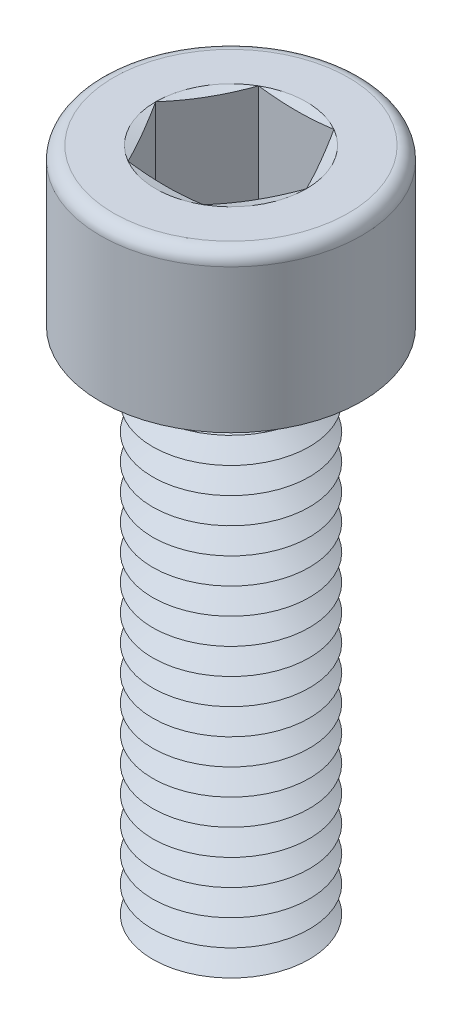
ISO-10303-21;
HEADER;
FILE_DESCRIPTION(('STEP AP214'),'2;1');
FILE_NAME('part.step','',(''),(''),'','','');
FILE_SCHEMA(('AUTOMOTIVE_DESIGN { 1 0 10303 214 1 1 1 1 }'));
ENDSEC;
DATA;
#1=APPLICATION_CONTEXT('core data for automotive mechanical design processes');
#2=APPLICATION_PROTOCOL_DEFINITION('international standard','automotive_design',2000,#1);
#3=PRODUCT_CONTEXT('',#1,'mechanical');
#4=PRODUCT('Part','Part','',(#3));
#5=PRODUCT_RELATED_PRODUCT_CATEGORY('part','',(#4));
#6=PRODUCT_DEFINITION_FORMATION('','',#4);
#7=PRODUCT_DEFINITION_CONTEXT('part definition',#1,'design');
#8=PRODUCT_DEFINITION('design','',#6,#7);
#9=PRODUCT_DEFINITION_SHAPE('','',#8);
#10=(LENGTH_UNIT() NAMED_UNIT(*) SI_UNIT(.MILLI.,.METRE.));
#11=(NAMED_UNIT(*) PLANE_ANGLE_UNIT() SI_UNIT($,.RADIAN.));
#12=(NAMED_UNIT(*) SI_UNIT($,.STERADIAN.) SOLID_ANGLE_UNIT());
#13=UNCERTAINTY_MEASURE_WITH_UNIT(LENGTH_MEASURE(1.E-05),#10,'distance_accuracy_value','');
#14=(GEOMETRIC_REPRESENTATION_CONTEXT(3) GLOBAL_UNCERTAINTY_ASSIGNED_CONTEXT((#13)) GLOBAL_UNIT_ASSIGNED_CONTEXT((#10,
#11,#12)) REPRESENTATION_CONTEXT('',''));
#15=CARTESIAN_POINT('',(0.,0.,0.));
#16=DIRECTION('',(0.,0.,1.));
#17=DIRECTION('',(1.,0.,0.));
#18=AXIS2_PLACEMENT_3D('',#15,#16,#17);
#19=CARTESIAN_POINT('',(0.,4.,0.));
#20=DIRECTION('',(0.,1.,0.));
#21=DIRECTION('',(0.,0.,1.));
#22=AXIS2_PLACEMENT_3D('',#19,#20,#21);
#23=CONICAL_SURFACE('',#22,2.13397459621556,1.0471975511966);
#24=CARTESIAN_POINT('',(0.,4.5,0.));
#25=DIRECTION('',(0.,1.,0.));
#26=DIRECTION('',(0.,0.,1.));
#27=AXIS2_PLACEMENT_3D('',#24,#25,#26);
#28=CIRCLE('',#27,3.);
#29=CARTESIAN_POINT('',(0.,4.5,3.));
#30=VERTEX_POINT('',#29);
#31=EDGE_CURVE('E471',#30,#30,#28,.T.);
#32=ORIENTED_EDGE('',*,*,#31,.F.);
#33=EDGE_LOOP('',(#32));
#34=FACE_BOUND('',#33,.T.);
#35=CARTESIAN_POINT('',(0.,4.,0.));
#36=DIRECTION('',(0.,1.,0.));
#37=DIRECTION('',(0.,0.,1.));
#38=AXIS2_PLACEMENT_3D('',#35,#36,#37);
#39=CIRCLE('',#38,2.13397459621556);
#40=CARTESIAN_POINT('',(0.,4.,2.13397459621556));
#41=VERTEX_POINT('',#40);
#42=EDGE_CURVE('E475',#41,#41,#39,.T.);
#43=ORIENTED_EDGE('',*,*,#42,.T.);
#44=EDGE_LOOP('',(#43));
#45=FACE_BOUND('',#44,.T.);
#46=ADVANCED_FACE('F41',(#34,#45),#23,.T.);
#47=CARTESIAN_POINT('',(0.,3.5,0.));
#48=DIRECTION('',(0.,-1.,0.));
#49=DIRECTION('',(0.,0.,-1.));
#50=AXIS2_PLACEMENT_3D('',#47,#48,#49);
#51=CONICAL_SURFACE('',#50,3.,1.0471975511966);
#52=ORIENTED_EDGE('',*,*,#42,.F.);
#53=EDGE_LOOP('',(#52));
#54=FACE_BOUND('',#53,.T.);
#55=CARTESIAN_POINT('',(0.,3.5,0.));
#56=DIRECTION('',(0.,1.,0.));
#57=DIRECTION('',(0.,0.,1.));
#58=AXIS2_PLACEMENT_3D('',#55,#56,#57);
#59=CIRCLE('',#58,3.);
#60=CARTESIAN_POINT('',(0.,3.5,3.));
#61=VERTEX_POINT('',#60);
#62=EDGE_CURVE('E479',#61,#61,#59,.T.);
#63=ORIENTED_EDGE('',*,*,#62,.T.);
#64=EDGE_LOOP('',(#63));
#65=FACE_BOUND('',#64,.T.);
#66=ADVANCED_FACE('F251',(#54,#65),#51,.T.);
#67=CARTESIAN_POINT('',(0.,0.,0.));
#68=DIRECTION('',(0.,1.,0.));
#69=DIRECTION('',(0.,0.,1.));
#70=AXIS2_PLACEMENT_3D('',#67,#68,#69);
#71=PLANE('',#70);
#72=CARTESIAN_POINT('',(0.,0.,0.));
#73=DIRECTION('',(0.,1.,0.));
#74=DIRECTION('',(0.,0.,1.));
#75=AXIS2_PLACEMENT_3D('',#72,#73,#74);
#76=CIRCLE('',#75,2.13397459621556);
#77=CARTESIAN_POINT('',(0.,0.,2.13397459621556));
#78=VERTEX_POINT('',#77);
#79=EDGE_CURVE('E507',#78,#78,#76,.T.);
#80=ORIENTED_EDGE('',*,*,#79,.F.);
#81=EDGE_LOOP('',(#80));
#82=FACE_BOUND('',#81,.T.);
#83=ADVANCED_FACE('F248',(#82),#71,.F.);
#84=CARTESIAN_POINT('',(0.,0.,0.));
#85=DIRECTION('',(0.,1.,0.));
#86=DIRECTION('',(0.,0.,1.));
#87=AXIS2_PLACEMENT_3D('',#84,#85,#86);
#88=CONICAL_SURFACE('',#87,2.13397459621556,1.0471975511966);
#89=CARTESIAN_POINT('',(0.,0.5,0.));
#90=DIRECTION('',(0.,1.,0.));
#91=DIRECTION('',(0.,0.,1.));
#92=AXIS2_PLACEMENT_3D('',#89,#90,#91);
#93=CIRCLE('',#92,3.);
#94=CARTESIAN_POINT('',(0.,0.5,3.));
#95=VERTEX_POINT('',#94);
#96=EDGE_CURVE('E503',#95,#95,#93,.T.);
#97=ORIENTED_EDGE('',*,*,#96,.F.);
#98=EDGE_LOOP('',(#97));
#99=FACE_BOUND('',#98,.T.);
#100=ORIENTED_EDGE('',*,*,#79,.T.);
#101=EDGE_LOOP('',(#100));
#102=FACE_BOUND('',#101,.T.);
#103=ADVANCED_FACE('F250',(#99,#102),#88,.T.);
#104=CARTESIAN_POINT('',(0.,0.5,0.));
#105=DIRECTION('',(0.,-1.,0.));
#106=DIRECTION('',(0.,0.,-1.));
#107=AXIS2_PLACEMENT_3D('',#104,#105,#106);
#108=CONICAL_SURFACE('',#107,3.,1.0471975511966);
#109=CARTESIAN_POINT('',(0.,1.,0.));
#110=DIRECTION('',(0.,1.,0.));
#111=DIRECTION('',(0.,0.,1.));
#112=AXIS2_PLACEMENT_3D('',#109,#110,#111);
#113=CIRCLE('',#112,2.13397459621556);
#114=CARTESIAN_POINT('',(0.,1.,2.13397459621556));
#115=VERTEX_POINT('',#114);
#116=EDGE_CURVE('E499',#115,#115,#113,.T.);
#117=ORIENTED_EDGE('',*,*,#116,.F.);
#118=EDGE_LOOP('',(#117));
#119=FACE_BOUND('',#118,.T.);
#120=ORIENTED_EDGE('',*,*,#96,.T.);
#121=EDGE_LOOP('',(#120));
#122=FACE_BOUND('',#121,.T.);
#123=ADVANCED_FACE('F291',(#119,#122),#108,.T.);
#124=CARTESIAN_POINT('',(0.,1.,0.));
#125=DIRECTION('',(0.,1.,0.));
#126=DIRECTION('',(0.,0.,1.));
#127=AXIS2_PLACEMENT_3D('',#124,#125,#126);
#128=CONICAL_SURFACE('',#127,2.13397459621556,1.0471975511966);
#129=CARTESIAN_POINT('',(0.,1.5,0.));
#130=DIRECTION('',(0.,1.,0.));
#131=DIRECTION('',(0.,0.,1.));
#132=AXIS2_PLACEMENT_3D('',#129,#130,#131);
#133=CIRCLE('',#132,3.);
#134=CARTESIAN_POINT('',(0.,1.5,3.));
#135=VERTEX_POINT('',#134);
#136=EDGE_CURVE('E495',#135,#135,#133,.T.);
#137=ORIENTED_EDGE('',*,*,#136,.F.);
#138=EDGE_LOOP('',(#137));
#139=FACE_BOUND('',#138,.T.);
#140=ORIENTED_EDGE('',*,*,#116,.T.);
#141=EDGE_LOOP('',(#140));
#142=FACE_BOUND('',#141,.T.);
#143=ADVANCED_FACE('F286',(#139,#142),#128,.T.);
#144=CARTESIAN_POINT('',(0.,1.5,0.));
#145=DIRECTION('',(0.,-1.,0.));
#146=DIRECTION('',(0.,0.,-1.));
#147=AXIS2_PLACEMENT_3D('',#144,#145,#146);
#148=CONICAL_SURFACE('',#147,3.,1.0471975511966);
#149=CARTESIAN_POINT('',(0.,2.,0.));
#150=DIRECTION('',(0.,1.,0.));
#151=DIRECTION('',(0.,0.,1.));
#152=AXIS2_PLACEMENT_3D('',#149,#150,#151);
#153=CIRCLE('',#152,2.13397459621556);
#154=CARTESIAN_POINT('',(0.,2.,2.13397459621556));
#155=VERTEX_POINT('',#154);
#156=EDGE_CURVE('E491',#155,#155,#153,.T.);
#157=ORIENTED_EDGE('',*,*,#156,.F.);
#158=EDGE_LOOP('',(#157));
#159=FACE_BOUND('',#158,.T.);
#160=ORIENTED_EDGE('',*,*,#136,.T.);
#161=EDGE_LOOP('',(#160));
#162=FACE_BOUND('',#161,.T.);
#163=ADVANCED_FACE('F283',(#159,#162),#148,.T.);
#164=CARTESIAN_POINT('',(0.,2.,0.));
#165=DIRECTION('',(0.,1.,0.));
#166=DIRECTION('',(0.,0.,1.));
#167=AXIS2_PLACEMENT_3D('',#164,#165,#166);
#168=CONICAL_SURFACE('',#167,2.13397459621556,1.0471975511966);
#169=CARTESIAN_POINT('',(0.,2.5,0.));
#170=DIRECTION('',(0.,1.,0.));
#171=DIRECTION('',(0.,0.,1.));
#172=AXIS2_PLACEMENT_3D('',#169,#170,#171);
#173=CIRCLE('',#172,3.);
#174=CARTESIAN_POINT('',(0.,2.5,3.));
#175=VERTEX_POINT('',#174);
#176=EDGE_CURVE('E487',#175,#175,#173,.T.);
#177=ORIENTED_EDGE('',*,*,#176,.F.);
#178=EDGE_LOOP('',(#177));
#179=FACE_BOUND('',#178,.T.);
#180=ORIENTED_EDGE('',*,*,#156,.T.);
#181=EDGE_LOOP('',(#180));
#182=FACE_BOUND('',#181,.T.);
#183=ADVANCED_FACE('F277',(#179,#182),#168,.T.);
#184=CARTESIAN_POINT('',(0.,2.5,0.));
#185=DIRECTION('',(0.,-1.,0.));
#186=DIRECTION('',(0.,0.,-1.));
#187=AXIS2_PLACEMENT_3D('',#184,#185,#186);
#188=CONICAL_SURFACE('',#187,3.,1.0471975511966);
#189=CARTESIAN_POINT('',(0.,3.,0.));
#190=DIRECTION('',(0.,1.,0.));
#191=DIRECTION('',(0.,0.,1.));
#192=AXIS2_PLACEMENT_3D('',#189,#190,#191);
#193=CIRCLE('',#192,2.13397459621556);
#194=CARTESIAN_POINT('',(0.,3.,2.13397459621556));
#195=VERTEX_POINT('',#194);
#196=EDGE_CURVE('E483',#195,#195,#193,.T.);
#197=ORIENTED_EDGE('',*,*,#196,.F.);
#198=EDGE_LOOP('',(#197));
#199=FACE_BOUND('',#198,.T.);
#200=ORIENTED_EDGE('',*,*,#176,.T.);
#201=EDGE_LOOP('',(#200));
#202=FACE_BOUND('',#201,.T.);
#203=ADVANCED_FACE('F273',(#199,#202),#188,.T.);
#204=CARTESIAN_POINT('',(0.,3.,0.));
#205=DIRECTION('',(0.,1.,0.));
#206=DIRECTION('',(0.,0.,1.));
#207=AXIS2_PLACEMENT_3D('',#204,#205,#206);
#208=CONICAL_SURFACE('',#207,2.13397459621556,1.0471975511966);
#209=ORIENTED_EDGE('',*,*,#62,.F.);
#210=EDGE_LOOP('',(#209));
#211=FACE_BOUND('',#210,.T.);
#212=ORIENTED_EDGE('',*,*,#196,.T.);
#213=EDGE_LOOP('',(#212));
#214=FACE_BOUND('',#213,.T.);
#215=ADVANCED_FACE('F276',(#211,#214),#208,.T.);
#216=CARTESIAN_POINT('',(0.,5.,0.));
#217=DIRECTION('',(0.,1.,0.));
#218=DIRECTION('',(0.,0.,1.));
#219=AXIS2_PLACEMENT_3D('',#216,#217,#218);
#220=CONICAL_SURFACE('',#219,2.13397459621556,1.0471975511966);
#221=CARTESIAN_POINT('',(0.,5.5,0.));
#222=DIRECTION('',(0.,1.,0.));
#223=DIRECTION('',(0.,0.,1.));
#224=AXIS2_PLACEMENT_3D('',#221,#222,#223);
#225=CIRCLE('',#224,3.);
#226=CARTESIAN_POINT('',(0.,5.5,3.));
#227=VERTEX_POINT('',#226);
#228=EDGE_CURVE('E463',#227,#227,#225,.T.);
#229=ORIENTED_EDGE('',*,*,#228,.F.);
#230=EDGE_LOOP('',(#229));
#231=FACE_BOUND('',#230,.T.);
#232=CARTESIAN_POINT('',(0.,5.,0.));
#233=DIRECTION('',(0.,1.,0.));
#234=DIRECTION('',(0.,0.,1.));
#235=AXIS2_PLACEMENT_3D('',#232,#233,#234);
#236=CIRCLE('',#235,2.13397459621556);
#237=CARTESIAN_POINT('',(0.,5.,2.13397459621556));
#238=VERTEX_POINT('',#237);
#239=EDGE_CURVE('E467',#238,#238,#236,.T.);
#240=ORIENTED_EDGE('',*,*,#239,.T.);
#241=EDGE_LOOP('',(#240));
#242=FACE_BOUND('',#241,.T.);
#243=ADVANCED_FACE('F281',(#231,#242),#220,.T.);
#244=CARTESIAN_POINT('',(0.,4.5,0.));
#245=DIRECTION('',(0.,-1.,0.));
#246=DIRECTION('',(0.,0.,-1.));
#247=AXIS2_PLACEMENT_3D('',#244,#245,#246);
#248=CONICAL_SURFACE('',#247,3.,1.0471975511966);
#249=ORIENTED_EDGE('',*,*,#239,.F.);
#250=EDGE_LOOP('',(#249));
#251=FACE_BOUND('',#250,.T.);
#252=ORIENTED_EDGE('',*,*,#31,.T.);
#253=EDGE_LOOP('',(#252));
#254=FACE_BOUND('',#253,.T.);
#255=ADVANCED_FACE('F738',(#251,#254),#248,.T.);
#256=CARTESIAN_POINT('',(0.,6.,0.));
#257=DIRECTION('',(0.,1.,0.));
#258=DIRECTION('',(0.,0.,1.));
#259=AXIS2_PLACEMENT_3D('',#256,#257,#258);
#260=CONICAL_SURFACE('',#259,2.13397459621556,1.0471975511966);
#261=CARTESIAN_POINT('',(0.,6.5,0.));
#262=DIRECTION('',(0.,1.,0.));
#263=DIRECTION('',(0.,0.,1.));
#264=AXIS2_PLACEMENT_3D('',#261,#262,#263);
#265=CIRCLE('',#264,3.);
#266=CARTESIAN_POINT('',(0.,6.5,3.));
#267=VERTEX_POINT('',#266);
#268=EDGE_CURVE('E455',#267,#267,#265,.T.);
#269=ORIENTED_EDGE('',*,*,#268,.F.);
#270=EDGE_LOOP('',(#269));
#271=FACE_BOUND('',#270,.T.);
#272=CARTESIAN_POINT('',(0.,6.,0.));
#273=DIRECTION('',(0.,1.,0.));
#274=DIRECTION('',(0.,0.,1.));
#275=AXIS2_PLACEMENT_3D('',#272,#273,#274);
#276=CIRCLE('',#275,2.13397459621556);
#277=CARTESIAN_POINT('',(0.,6.,2.13397459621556));
#278=VERTEX_POINT('',#277);
#279=EDGE_CURVE('E459',#278,#278,#276,.T.);
#280=ORIENTED_EDGE('',*,*,#279,.T.);
#281=EDGE_LOOP('',(#280));
#282=FACE_BOUND('',#281,.T.);
#283=ADVANCED_FACE('F747',(#271,#282),#260,.T.);
#284=CARTESIAN_POINT('',(0.,5.5,0.));
#285=DIRECTION('',(0.,-1.,0.));
#286=DIRECTION('',(0.,0.,-1.));
#287=AXIS2_PLACEMENT_3D('',#284,#285,#286);
#288=CONICAL_SURFACE('',#287,3.,1.0471975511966);
#289=ORIENTED_EDGE('',*,*,#279,.F.);
#290=EDGE_LOOP('',(#289));
#291=FACE_BOUND('',#290,.T.);
#292=ORIENTED_EDGE('',*,*,#228,.T.);
#293=EDGE_LOOP('',(#292));
#294=FACE_BOUND('',#293,.T.);
#295=ADVANCED_FACE('F757',(#291,#294),#288,.T.);
#296=CARTESIAN_POINT('',(0.,7.,0.));
#297=DIRECTION('',(0.,1.,0.));
#298=DIRECTION('',(0.,0.,1.));
#299=AXIS2_PLACEMENT_3D('',#296,#297,#298);
#300=CONICAL_SURFACE('',#299,2.13397459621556,1.0471975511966);
#301=CARTESIAN_POINT('',(0.,7.5,0.));
#302=DIRECTION('',(0.,1.,0.));
#303=DIRECTION('',(0.,0.,1.));
#304=AXIS2_PLACEMENT_3D('',#301,#302,#303);
#305=CIRCLE('',#304,3.);
#306=CARTESIAN_POINT('',(0.,7.5,3.));
#307=VERTEX_POINT('',#306);
#308=EDGE_CURVE('E447',#307,#307,#305,.T.);
#309=ORIENTED_EDGE('',*,*,#308,.F.);
#310=EDGE_LOOP('',(#309));
#311=FACE_BOUND('',#310,.T.);
#312=CARTESIAN_POINT('',(0.,7.,0.));
#313=DIRECTION('',(0.,1.,0.));
#314=DIRECTION('',(0.,0.,1.));
#315=AXIS2_PLACEMENT_3D('',#312,#313,#314);
#316=CIRCLE('',#315,2.13397459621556);
#317=CARTESIAN_POINT('',(0.,7.,2.13397459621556));
#318=VERTEX_POINT('',#317);
#319=EDGE_CURVE('E451',#318,#318,#316,.T.);
#320=ORIENTED_EDGE('',*,*,#319,.T.);
#321=EDGE_LOOP('',(#320));
#322=FACE_BOUND('',#321,.T.);
#323=ADVANCED_FACE('F767',(#311,#322),#300,.T.);
#324=CARTESIAN_POINT('',(0.,6.5,0.));
#325=DIRECTION('',(0.,-1.,0.));
#326=DIRECTION('',(0.,0.,-1.));
#327=AXIS2_PLACEMENT_3D('',#324,#325,#326);
#328=CONICAL_SURFACE('',#327,3.,1.0471975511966);
#329=ORIENTED_EDGE('',*,*,#319,.F.);
#330=EDGE_LOOP('',(#329));
#331=FACE_BOUND('',#330,.T.);
#332=ORIENTED_EDGE('',*,*,#268,.T.);
#333=EDGE_LOOP('',(#332));
#334=FACE_BOUND('',#333,.T.);
#335=ADVANCED_FACE('F777',(#331,#334),#328,.T.);
#336=CARTESIAN_POINT('',(0.,8.,0.));
#337=DIRECTION('',(0.,1.,0.));
#338=DIRECTION('',(0.,0.,1.));
#339=AXIS2_PLACEMENT_3D('',#336,#337,#338);
#340=CONICAL_SURFACE('',#339,2.13397459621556,1.0471975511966);
#341=CARTESIAN_POINT('',(0.,8.5,0.));
#342=DIRECTION('',(0.,1.,0.));
#343=DIRECTION('',(0.,0.,1.));
#344=AXIS2_PLACEMENT_3D('',#341,#342,#343);
#345=CIRCLE('',#344,3.);
#346=CARTESIAN_POINT('',(0.,8.5,3.));
#347=VERTEX_POINT('',#346);
#348=EDGE_CURVE('E439',#347,#347,#345,.T.);
#349=ORIENTED_EDGE('',*,*,#348,.F.);
#350=EDGE_LOOP('',(#349));
#351=FACE_BOUND('',#350,.T.);
#352=CARTESIAN_POINT('',(0.,8.,0.));
#353=DIRECTION('',(0.,1.,0.));
#354=DIRECTION('',(0.,0.,1.));
#355=AXIS2_PLACEMENT_3D('',#352,#353,#354);
#356=CIRCLE('',#355,2.13397459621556);
#357=CARTESIAN_POINT('',(0.,8.,2.13397459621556));
#358=VERTEX_POINT('',#357);
#359=EDGE_CURVE('E443',#358,#358,#356,.T.);
#360=ORIENTED_EDGE('',*,*,#359,.T.);
#361=EDGE_LOOP('',(#360));
#362=FACE_BOUND('',#361,.T.);
#363=ADVANCED_FACE('F787',(#351,#362),#340,.T.);
#364=CARTESIAN_POINT('',(0.,7.5,0.));
#365=DIRECTION('',(0.,-1.,0.));
#366=DIRECTION('',(0.,0.,-1.));
#367=AXIS2_PLACEMENT_3D('',#364,#365,#366);
#368=CONICAL_SURFACE('',#367,3.,1.0471975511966);
#369=ORIENTED_EDGE('',*,*,#359,.F.);
#370=EDGE_LOOP('',(#369));
#371=FACE_BOUND('',#370,.T.);
#372=ORIENTED_EDGE('',*,*,#308,.T.);
#373=EDGE_LOOP('',(#372));
#374=FACE_BOUND('',#373,.T.);
#375=ADVANCED_FACE('F797',(#371,#374),#368,.T.);
#376=CARTESIAN_POINT('',(0.,9.,0.));
#377=DIRECTION('',(0.,1.,0.));
#378=DIRECTION('',(0.,0.,1.));
#379=AXIS2_PLACEMENT_3D('',#376,#377,#378);
#380=CONICAL_SURFACE('',#379,2.13397459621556,1.0471975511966);
#381=CARTESIAN_POINT('',(0.,9.5,0.));
#382=DIRECTION('',(0.,1.,0.));
#383=DIRECTION('',(0.,0.,1.));
#384=AXIS2_PLACEMENT_3D('',#381,#382,#383);
#385=CIRCLE('',#384,3.);
#386=CARTESIAN_POINT('',(0.,9.5,3.));
#387=VERTEX_POINT('',#386);
#388=EDGE_CURVE('E431',#387,#387,#385,.T.);
#389=ORIENTED_EDGE('',*,*,#388,.F.);
#390=EDGE_LOOP('',(#389));
#391=FACE_BOUND('',#390,.T.);
#392=CARTESIAN_POINT('',(0.,9.,0.));
#393=DIRECTION('',(0.,1.,0.));
#394=DIRECTION('',(0.,0.,1.));
#395=AXIS2_PLACEMENT_3D('',#392,#393,#394);
#396=CIRCLE('',#395,2.13397459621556);
#397=CARTESIAN_POINT('',(0.,9.,2.13397459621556));
#398=VERTEX_POINT('',#397);
#399=EDGE_CURVE('E435',#398,#398,#396,.T.);
#400=ORIENTED_EDGE('',*,*,#399,.T.);
#401=EDGE_LOOP('',(#400));
#402=FACE_BOUND('',#401,.T.);
#403=ADVANCED_FACE('F807',(#391,#402),#380,.T.);
#404=CARTESIAN_POINT('',(0.,8.5,0.));
#405=DIRECTION('',(0.,-1.,0.));
#406=DIRECTION('',(0.,0.,-1.));
#407=AXIS2_PLACEMENT_3D('',#404,#405,#406);
#408=CONICAL_SURFACE('',#407,3.,1.0471975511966);
#409=ORIENTED_EDGE('',*,*,#399,.F.);
#410=EDGE_LOOP('',(#409));
#411=FACE_BOUND('',#410,.T.);
#412=ORIENTED_EDGE('',*,*,#348,.T.);
#413=EDGE_LOOP('',(#412));
#414=FACE_BOUND('',#413,.T.);
#415=ADVANCED_FACE('F817',(#411,#414),#408,.T.);
#416=CARTESIAN_POINT('',(0.,10.,0.));
#417=DIRECTION('',(0.,1.,0.));
#418=DIRECTION('',(0.,0.,1.));
#419=AXIS2_PLACEMENT_3D('',#416,#417,#418);
#420=CONICAL_SURFACE('',#419,2.13397459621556,1.0471975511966);
#421=CARTESIAN_POINT('',(0.,10.5,0.));
#422=DIRECTION('',(0.,1.,0.));
#423=DIRECTION('',(0.,0.,1.));
#424=AXIS2_PLACEMENT_3D('',#421,#422,#423);
#425=CIRCLE('',#424,3.);
#426=CARTESIAN_POINT('',(0.,10.5,3.));
#427=VERTEX_POINT('',#426);
#428=EDGE_CURVE('E423',#427,#427,#425,.T.);
#429=ORIENTED_EDGE('',*,*,#428,.F.);
#430=EDGE_LOOP('',(#429));
#431=FACE_BOUND('',#430,.T.);
#432=CARTESIAN_POINT('',(0.,10.,0.));
#433=DIRECTION('',(0.,1.,0.));
#434=DIRECTION('',(0.,0.,1.));
#435=AXIS2_PLACEMENT_3D('',#432,#433,#434);
#436=CIRCLE('',#435,2.13397459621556);
#437=CARTESIAN_POINT('',(0.,10.,2.13397459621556));
#438=VERTEX_POINT('',#437);
#439=EDGE_CURVE('E427',#438,#438,#436,.T.);
#440=ORIENTED_EDGE('',*,*,#439,.T.);
#441=EDGE_LOOP('',(#440));
#442=FACE_BOUND('',#441,.T.);
#443=ADVANCED_FACE('F827',(#431,#442),#420,.T.);
#444=CARTESIAN_POINT('',(0.,9.5,0.));
#445=DIRECTION('',(0.,-1.,0.));
#446=DIRECTION('',(0.,0.,-1.));
#447=AXIS2_PLACEMENT_3D('',#444,#445,#446);
#448=CONICAL_SURFACE('',#447,3.,1.0471975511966);
#449=ORIENTED_EDGE('',*,*,#439,.F.);
#450=EDGE_LOOP('',(#449));
#451=FACE_BOUND('',#450,.T.);
#452=ORIENTED_EDGE('',*,*,#388,.T.);
#453=EDGE_LOOP('',(#452));
#454=FACE_BOUND('',#453,.T.);
#455=ADVANCED_FACE('F837',(#451,#454),#448,.T.);
#456=CARTESIAN_POINT('',(0.,11.,0.));
#457=DIRECTION('',(0.,1.,0.));
#458=DIRECTION('',(0.,0.,1.));
#459=AXIS2_PLACEMENT_3D('',#456,#457,#458);
#460=CONICAL_SURFACE('',#459,2.13397459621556,1.0471975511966);
#461=CARTESIAN_POINT('',(0.,11.5,0.));
#462=DIRECTION('',(0.,1.,0.));
#463=DIRECTION('',(0.,0.,1.));
#464=AXIS2_PLACEMENT_3D('',#461,#462,#463);
#465=CIRCLE('',#464,3.);
#466=CARTESIAN_POINT('',(0.,11.5,3.));
#467=VERTEX_POINT('',#466);
#468=EDGE_CURVE('E415',#467,#467,#465,.T.);
#469=ORIENTED_EDGE('',*,*,#468,.F.);
#470=EDGE_LOOP('',(#469));
#471=FACE_BOUND('',#470,.T.);
#472=CARTESIAN_POINT('',(0.,11.,0.));
#473=DIRECTION('',(0.,1.,0.));
#474=DIRECTION('',(0.,0.,1.));
#475=AXIS2_PLACEMENT_3D('',#472,#473,#474);
#476=CIRCLE('',#475,2.13397459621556);
#477=CARTESIAN_POINT('',(0.,11.,2.13397459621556));
#478=VERTEX_POINT('',#477);
#479=EDGE_CURVE('E419',#478,#478,#476,.T.);
#480=ORIENTED_EDGE('',*,*,#479,.T.);
#481=EDGE_LOOP('',(#480));
#482=FACE_BOUND('',#481,.T.);
#483=ADVANCED_FACE('F847',(#471,#482),#460,.T.);
#484=CARTESIAN_POINT('',(0.,10.5,0.));
#485=DIRECTION('',(0.,-1.,0.));
#486=DIRECTION('',(0.,0.,-1.));
#487=AXIS2_PLACEMENT_3D('',#484,#485,#486);
#488=CONICAL_SURFACE('',#487,3.,1.0471975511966);
#489=ORIENTED_EDGE('',*,*,#479,.F.);
#490=EDGE_LOOP('',(#489));
#491=FACE_BOUND('',#490,.T.);
#492=ORIENTED_EDGE('',*,*,#428,.T.);
#493=EDGE_LOOP('',(#492));
#494=FACE_BOUND('',#493,.T.);
#495=ADVANCED_FACE('F857',(#491,#494),#488,.T.);
#496=CARTESIAN_POINT('',(0.,12.,0.));
#497=DIRECTION('',(0.,1.,0.));
#498=DIRECTION('',(0.,0.,1.));
#499=AXIS2_PLACEMENT_3D('',#496,#497,#498);
#500=CONICAL_SURFACE('',#499,2.13397459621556,1.0471975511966);
#501=CARTESIAN_POINT('',(0.,12.5,0.));
#502=DIRECTION('',(0.,1.,0.));
#503=DIRECTION('',(0.,0.,1.));
#504=AXIS2_PLACEMENT_3D('',#501,#502,#503);
#505=CIRCLE('',#504,3.);
#506=CARTESIAN_POINT('',(0.,12.5,3.));
#507=VERTEX_POINT('',#506);
#508=EDGE_CURVE('E407',#507,#507,#505,.T.);
#509=ORIENTED_EDGE('',*,*,#508,.F.);
#510=EDGE_LOOP('',(#509));
#511=FACE_BOUND('',#510,.T.);
#512=CARTESIAN_POINT('',(0.,12.,0.));
#513=DIRECTION('',(0.,1.,0.));
#514=DIRECTION('',(0.,0.,1.));
#515=AXIS2_PLACEMENT_3D('',#512,#513,#514);
#516=CIRCLE('',#515,2.13397459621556);
#517=CARTESIAN_POINT('',(0.,12.,2.13397459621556));
#518=VERTEX_POINT('',#517);
#519=EDGE_CURVE('E411',#518,#518,#516,.T.);
#520=ORIENTED_EDGE('',*,*,#519,.T.);
#521=EDGE_LOOP('',(#520));
#522=FACE_BOUND('',#521,.T.);
#523=ADVANCED_FACE('F867',(#511,#522),#500,.T.);
#524=CARTESIAN_POINT('',(0.,11.5,0.));
#525=DIRECTION('',(0.,-1.,0.));
#526=DIRECTION('',(0.,0.,-1.));
#527=AXIS2_PLACEMENT_3D('',#524,#525,#526);
#528=CONICAL_SURFACE('',#527,3.,1.0471975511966);
#529=ORIENTED_EDGE('',*,*,#519,.F.);
#530=EDGE_LOOP('',(#529));
#531=FACE_BOUND('',#530,.T.);
#532=ORIENTED_EDGE('',*,*,#468,.T.);
#533=EDGE_LOOP('',(#532));
#534=FACE_BOUND('',#533,.T.);
#535=ADVANCED_FACE('F877',(#531,#534),#528,.T.);
#536=CARTESIAN_POINT('',(0.,13.,0.));
#537=DIRECTION('',(0.,1.,0.));
#538=DIRECTION('',(0.,0.,1.));
#539=AXIS2_PLACEMENT_3D('',#536,#537,#538);
#540=CONICAL_SURFACE('',#539,2.13397459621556,1.0471975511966);
#541=CARTESIAN_POINT('',(0.,13.5,0.));
#542=DIRECTION('',(0.,1.,0.));
#543=DIRECTION('',(0.,0.,1.));
#544=AXIS2_PLACEMENT_3D('',#541,#542,#543);
#545=CIRCLE('',#544,3.);
#546=CARTESIAN_POINT('',(0.,13.5,3.));
#547=VERTEX_POINT('',#546);
#548=EDGE_CURVE('E399',#547,#547,#545,.T.);
#549=ORIENTED_EDGE('',*,*,#548,.F.);
#550=EDGE_LOOP('',(#549));
#551=FACE_BOUND('',#550,.T.);
#552=CARTESIAN_POINT('',(0.,13.,0.));
#553=DIRECTION('',(0.,1.,0.));
#554=DIRECTION('',(0.,0.,1.));
#555=AXIS2_PLACEMENT_3D('',#552,#553,#554);
#556=CIRCLE('',#555,2.13397459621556);
#557=CARTESIAN_POINT('',(0.,13.,2.13397459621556));
#558=VERTEX_POINT('',#557);
#559=EDGE_CURVE('E403',#558,#558,#556,.T.);
#560=ORIENTED_EDGE('',*,*,#559,.T.);
#561=EDGE_LOOP('',(#560));
#562=FACE_BOUND('',#561,.T.);
#563=ADVANCED_FACE('F887',(#551,#562),#540,.T.);
#564=CARTESIAN_POINT('',(0.,12.5,0.));
#565=DIRECTION('',(0.,-1.,0.));
#566=DIRECTION('',(0.,0.,-1.));
#567=AXIS2_PLACEMENT_3D('',#564,#565,#566);
#568=CONICAL_SURFACE('',#567,3.,1.0471975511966);
#569=ORIENTED_EDGE('',*,*,#559,.F.);
#570=EDGE_LOOP('',(#569));
#571=FACE_BOUND('',#570,.T.);
#572=ORIENTED_EDGE('',*,*,#508,.T.);
#573=EDGE_LOOP('',(#572));
#574=FACE_BOUND('',#573,.T.);
#575=ADVANCED_FACE('F897',(#571,#574),#568,.T.);
#576=CARTESIAN_POINT('',(0.,14.,0.));
#577=DIRECTION('',(0.,1.,0.));
#578=DIRECTION('',(0.,0.,1.));
#579=AXIS2_PLACEMENT_3D('',#576,#577,#578);
#580=CONICAL_SURFACE('',#579,2.13397459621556,1.0471975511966);
#581=CARTESIAN_POINT('',(0.,14.5,0.));
#582=DIRECTION('',(0.,1.,0.));
#583=DIRECTION('',(0.,0.,1.));
#584=AXIS2_PLACEMENT_3D('',#581,#582,#583);
#585=CIRCLE('',#584,3.);
#586=CARTESIAN_POINT('',(0.,14.5,3.));
#587=VERTEX_POINT('',#586);
#588=EDGE_CURVE('E391',#587,#587,#585,.T.);
#589=ORIENTED_EDGE('',*,*,#588,.F.);
#590=EDGE_LOOP('',(#589));
#591=FACE_BOUND('',#590,.T.);
#592=CARTESIAN_POINT('',(0.,14.,0.));
#593=DIRECTION('',(0.,1.,0.));
#594=DIRECTION('',(0.,0.,1.));
#595=AXIS2_PLACEMENT_3D('',#592,#593,#594);
#596=CIRCLE('',#595,2.13397459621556);
#597=CARTESIAN_POINT('',(0.,14.,2.13397459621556));
#598=VERTEX_POINT('',#597);
#599=EDGE_CURVE('E395',#598,#598,#596,.T.);
#600=ORIENTED_EDGE('',*,*,#599,.T.);
#601=EDGE_LOOP('',(#600));
#602=FACE_BOUND('',#601,.T.);
#603=ADVANCED_FACE('F907',(#591,#602),#580,.T.);
#604=CARTESIAN_POINT('',(0.,13.5,0.));
#605=DIRECTION('',(0.,-1.,0.));
#606=DIRECTION('',(0.,0.,-1.));
#607=AXIS2_PLACEMENT_3D('',#604,#605,#606);
#608=CONICAL_SURFACE('',#607,3.,1.0471975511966);
#609=ORIENTED_EDGE('',*,*,#599,.F.);
#610=EDGE_LOOP('',(#609));
#611=FACE_BOUND('',#610,.T.);
#612=ORIENTED_EDGE('',*,*,#548,.T.);
#613=EDGE_LOOP('',(#612));
#614=FACE_BOUND('',#613,.T.);
#615=ADVANCED_FACE('F917',(#611,#614),#608,.T.);
#616=CARTESIAN_POINT('',(0.,15.,0.));
#617=DIRECTION('',(0.,1.,0.));
#618=DIRECTION('',(0.,0.,1.));
#619=AXIS2_PLACEMENT_3D('',#616,#617,#618);
#620=CONICAL_SURFACE('',#619,2.13397459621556,1.0471975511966);
#621=CARTESIAN_POINT('',(0.,15.5,0.));
#622=DIRECTION('',(0.,1.,0.));
#623=DIRECTION('',(0.,0.,1.));
#624=AXIS2_PLACEMENT_3D('',#621,#622,#623);
#625=CIRCLE('',#624,3.);
#626=CARTESIAN_POINT('',(0.,15.5,3.));
#627=VERTEX_POINT('',#626);
#628=EDGE_CURVE('E383',#627,#627,#625,.T.);
#629=ORIENTED_EDGE('',*,*,#628,.F.);
#630=EDGE_LOOP('',(#629));
#631=FACE_BOUND('',#630,.T.);
#632=CARTESIAN_POINT('',(0.,15.,0.));
#633=DIRECTION('',(0.,1.,0.));
#634=DIRECTION('',(0.,0.,1.));
#635=AXIS2_PLACEMENT_3D('',#632,#633,#634);
#636=CIRCLE('',#635,2.13397459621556);
#637=CARTESIAN_POINT('',(0.,15.,2.13397459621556));
#638=VERTEX_POINT('',#637);
#639=EDGE_CURVE('E387',#638,#638,#636,.T.);
#640=ORIENTED_EDGE('',*,*,#639,.T.);
#641=EDGE_LOOP('',(#640));
#642=FACE_BOUND('',#641,.T.);
#643=ADVANCED_FACE('F927',(#631,#642),#620,.T.);
#644=CARTESIAN_POINT('',(0.,14.5,0.));
#645=DIRECTION('',(0.,-1.,0.));
#646=DIRECTION('',(0.,0.,-1.));
#647=AXIS2_PLACEMENT_3D('',#644,#645,#646);
#648=CONICAL_SURFACE('',#647,3.,1.0471975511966);
#649=ORIENTED_EDGE('',*,*,#639,.F.);
#650=EDGE_LOOP('',(#649));
#651=FACE_BOUND('',#650,.T.);
#652=ORIENTED_EDGE('',*,*,#588,.T.);
#653=EDGE_LOOP('',(#652));
#654=FACE_BOUND('',#653,.T.);
#655=ADVANCED_FACE('F937',(#651,#654),#648,.T.);
#656=CARTESIAN_POINT('',(0.,16.,0.));
#657=DIRECTION('',(0.,1.,0.));
#658=DIRECTION('',(0.,0.,1.));
#659=AXIS2_PLACEMENT_3D('',#656,#657,#658);
#660=CONICAL_SURFACE('',#659,2.13397459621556,1.0471975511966);
#661=CARTESIAN_POINT('',(0.,16.5,0.));
#662=DIRECTION('',(0.,1.,0.));
#663=DIRECTION('',(0.,0.,1.));
#664=AXIS2_PLACEMENT_3D('',#661,#662,#663);
#665=CIRCLE('',#664,3.);
#666=CARTESIAN_POINT('',(0.,16.5,3.));
#667=VERTEX_POINT('',#666);
#668=EDGE_CURVE('E375',#667,#667,#665,.T.);
#669=ORIENTED_EDGE('',*,*,#668,.F.);
#670=EDGE_LOOP('',(#669));
#671=FACE_BOUND('',#670,.T.);
#672=CARTESIAN_POINT('',(0.,16.,0.));
#673=DIRECTION('',(0.,1.,0.));
#674=DIRECTION('',(0.,0.,1.));
#675=AXIS2_PLACEMENT_3D('',#672,#673,#674);
#676=CIRCLE('',#675,2.13397459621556);
#677=CARTESIAN_POINT('',(0.,16.,2.13397459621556));
#678=VERTEX_POINT('',#677);
#679=EDGE_CURVE('E379',#678,#678,#676,.T.);
#680=ORIENTED_EDGE('',*,*,#679,.T.);
#681=EDGE_LOOP('',(#680));
#682=FACE_BOUND('',#681,.T.);
#683=ADVANCED_FACE('F947',(#671,#682),#660,.T.);
#684=CARTESIAN_POINT('',(0.,15.5,0.));
#685=DIRECTION('',(0.,-1.,0.));
#686=DIRECTION('',(0.,0.,-1.));
#687=AXIS2_PLACEMENT_3D('',#684,#685,#686);
#688=CONICAL_SURFACE('',#687,3.,1.0471975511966);
#689=ORIENTED_EDGE('',*,*,#679,.F.);
#690=EDGE_LOOP('',(#689));
#691=FACE_BOUND('',#690,.T.);
#692=ORIENTED_EDGE('',*,*,#628,.T.);
#693=EDGE_LOOP('',(#692));
#694=FACE_BOUND('',#693,.T.);
#695=ADVANCED_FACE('F957',(#691,#694),#688,.T.);
#696=CARTESIAN_POINT('',(0.,17.,0.));
#697=DIRECTION('',(0.,1.,0.));
#698=DIRECTION('',(0.,0.,1.));
#699=AXIS2_PLACEMENT_3D('',#696,#697,#698);
#700=CONICAL_SURFACE('',#699,2.13397459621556,1.0471975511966);
#701=CARTESIAN_POINT('',(0.,17.5,0.));
#702=DIRECTION('',(0.,1.,0.));
#703=DIRECTION('',(0.,0.,1.));
#704=AXIS2_PLACEMENT_3D('',#701,#702,#703);
#705=CIRCLE('',#704,3.);
#706=CARTESIAN_POINT('',(0.,17.5,3.));
#707=VERTEX_POINT('',#706);
#708=EDGE_CURVE('E368',#707,#707,#705,.T.);
#709=ORIENTED_EDGE('',*,*,#708,.F.);
#710=EDGE_LOOP('',(#709));
#711=FACE_BOUND('',#710,.T.);
#712=CARTESIAN_POINT('',(0.,17.,0.));
#713=DIRECTION('',(0.,1.,0.));
#714=DIRECTION('',(0.,0.,1.));
#715=AXIS2_PLACEMENT_3D('',#712,#713,#714);
#716=CIRCLE('',#715,2.13397459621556);
#717=CARTESIAN_POINT('',(0.,17.,2.13397459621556));
#718=VERTEX_POINT('',#717);
#719=EDGE_CURVE('E372',#718,#718,#716,.T.);
#720=ORIENTED_EDGE('',*,*,#719,.T.);
#721=EDGE_LOOP('',(#720));
#722=FACE_BOUND('',#721,.T.);
#723=ADVANCED_FACE('F967',(#711,#722),#700,.T.);
#724=CARTESIAN_POINT('',(0.,16.5,0.));
#725=DIRECTION('',(0.,-1.,0.));
#726=DIRECTION('',(0.,0.,-1.));
#727=AXIS2_PLACEMENT_3D('',#724,#725,#726);
#728=CONICAL_SURFACE('',#727,3.,1.0471975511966);
#729=ORIENTED_EDGE('',*,*,#719,.F.);
#730=EDGE_LOOP('',(#729));
#731=FACE_BOUND('',#730,.T.);
#732=ORIENTED_EDGE('',*,*,#668,.T.);
#733=EDGE_LOOP('',(#732));
#734=FACE_BOUND('',#733,.T.);
#735=ADVANCED_FACE('F977',(#731,#734),#728,.T.);
#736=CARTESIAN_POINT('',(0.,18.,0.));
#737=DIRECTION('',(0.,1.,0.));
#738=DIRECTION('',(0.,0.,1.));
#739=AXIS2_PLACEMENT_3D('',#736,#737,#738);
#740=CONICAL_SURFACE('',#739,2.13397459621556,1.0471975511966);
#741=CARTESIAN_POINT('',(0.,18.5,0.));
#742=DIRECTION('',(0.,1.,0.));
#743=DIRECTION('',(0.,0.,1.));
#744=AXIS2_PLACEMENT_3D('',#741,#742,#743);
#745=CIRCLE('',#744,3.);
#746=CARTESIAN_POINT('',(0.,18.5,3.));
#747=VERTEX_POINT('',#746);
#748=EDGE_CURVE('E353',#747,#747,#745,.T.);
#749=ORIENTED_EDGE('',*,*,#748,.F.);
#750=EDGE_LOOP('',(#749));
#751=FACE_BOUND('',#750,.T.);
#752=CARTESIAN_POINT('',(0.,18.,0.));
#753=DIRECTION('',(0.,1.,0.));
#754=DIRECTION('',(0.,0.,1.));
#755=AXIS2_PLACEMENT_3D('',#752,#753,#754);
#756=CIRCLE('',#755,2.13397459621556);
#757=CARTESIAN_POINT('',(0.,18.,2.13397459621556));
#758=VERTEX_POINT('',#757);
#759=EDGE_CURVE('E365',#758,#758,#756,.T.);
#760=ORIENTED_EDGE('',*,*,#759,.T.);
#761=EDGE_LOOP('',(#760));
#762=FACE_BOUND('',#761,.T.);
#763=ADVANCED_FACE('F987',(#751,#762),#740,.T.);
#764=CARTESIAN_POINT('',(0.,17.5,0.));
#765=DIRECTION('',(0.,-1.,0.));
#766=DIRECTION('',(0.,0.,-1.));
#767=AXIS2_PLACEMENT_3D('',#764,#765,#766);
#768=CONICAL_SURFACE('',#767,3.,1.0471975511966);
#769=ORIENTED_EDGE('',*,*,#759,.F.);
#770=EDGE_LOOP('',(#769));
#771=FACE_BOUND('',#770,.T.);
#772=ORIENTED_EDGE('',*,*,#708,.T.);
#773=EDGE_LOOP('',(#772));
#774=FACE_BOUND('',#773,.T.);
#775=ADVANCED_FACE('F997',(#771,#774),#768,.T.);
#776=CARTESIAN_POINT('',(0.,19.,0.));
#777=DIRECTION('',(0.,1.,0.));
#778=DIRECTION('',(0.,0.,1.));
#779=AXIS2_PLACEMENT_3D('',#776,#777,#778);
#780=CONICAL_SURFACE('',#779,2.13397459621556,1.0471975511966);
#781=CARTESIAN_POINT('',(0.,19.5,0.));
#782=DIRECTION('',(0.,1.,0.));
#783=DIRECTION('',(0.,0.,1.));
#784=AXIS2_PLACEMENT_3D('',#781,#782,#783);
#785=CIRCLE('',#784,3.);
#786=CARTESIAN_POINT('',(0.,19.5,3.));
#787=VERTEX_POINT('',#786);
#788=EDGE_CURVE('E360',#787,#787,#785,.T.);
#789=ORIENTED_EDGE('',*,*,#788,.F.);
#790=EDGE_LOOP('',(#789));
#791=FACE_BOUND('',#790,.T.);
#792=CARTESIAN_POINT('',(0.,19.,0.));
#793=DIRECTION('',(0.,1.,0.));
#794=DIRECTION('',(0.,0.,1.));
#795=AXIS2_PLACEMENT_3D('',#792,#793,#794);
#796=CIRCLE('',#795,2.13397459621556);
#797=CARTESIAN_POINT('',(0.,19.,2.13397459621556));
#798=VERTEX_POINT('',#797);
#799=EDGE_CURVE('E348',#798,#798,#796,.T.);
#800=ORIENTED_EDGE('',*,*,#799,.T.);
#801=EDGE_LOOP('',(#800));
#802=FACE_BOUND('',#801,.T.);
#803=ADVANCED_FACE('F1007',(#791,#802),#780,.T.);
#804=CARTESIAN_POINT('',(0.,18.5,0.));
#805=DIRECTION('',(0.,-1.,0.));
#806=DIRECTION('',(0.,0.,-1.));
#807=AXIS2_PLACEMENT_3D('',#804,#805,#806);
#808=CONICAL_SURFACE('',#807,3.,1.0471975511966);
#809=ORIENTED_EDGE('',*,*,#799,.F.);
#810=EDGE_LOOP('',(#809));
#811=FACE_BOUND('',#810,.T.);
#812=ORIENTED_EDGE('',*,*,#748,.T.);
#813=EDGE_LOOP('',(#812));
#814=FACE_BOUND('',#813,.T.);
#815=ADVANCED_FACE('F195',(#811,#814),#808,.T.);
#816=CARTESIAN_POINT('',(0.,26.,0.));
#817=DIRECTION('',(0.,1.,0.));
#818=DIRECTION('',(0.,0.,1.));
#819=AXIS2_PLACEMENT_3D('',#816,#817,#818);
#820=PLANE('',#819);
#821=CARTESIAN_POINT('',(0.,26.,0.));
#822=DIRECTION('',(0.,1.,0.));
#823=DIRECTION('',(0.,0.,1.));
#824=AXIS2_PLACEMENT_3D('',#821,#822,#823);
#825=CIRCLE('',#824,2.88675134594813);
#826=CARTESIAN_POINT('',(1.44337567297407,26.,2.5));
#827=VERTEX_POINT('',#826);
#828=CARTESIAN_POINT('',(2.88675134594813,26.,0.));
#829=VERTEX_POINT('',#828);
#830=EDGE_CURVE('E121',#827,#829,#825,.T.);
#831=ORIENTED_EDGE('',*,*,#830,.F.);
#832=CARTESIAN_POINT('',(0.,26.,0.));
#833=DIRECTION('',(0.,1.,0.));
#834=DIRECTION('',(0.,0.,1.));
#835=AXIS2_PLACEMENT_3D('',#832,#833,#834);
#836=CIRCLE('',#835,2.88675134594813);
#837=CARTESIAN_POINT('',(-1.44337567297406,26.,2.5));
#838=VERTEX_POINT('',#837);
#839=EDGE_CURVE('E45',#838,#827,#836,.T.);
#840=ORIENTED_EDGE('',*,*,#839,.F.);
#841=CARTESIAN_POINT('',(-2.88675134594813,26.,0.));
#842=VERTEX_POINT('',#841);
#843=EDGE_CURVE('E138',#842,#838,#836,.T.);
#844=ORIENTED_EDGE('',*,*,#843,.F.);
#845=CARTESIAN_POINT('',(-1.44337567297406,26.,-2.5));
#846=VERTEX_POINT('',#845);
#847=EDGE_CURVE('E1155',#846,#842,#836,.T.);
#848=ORIENTED_EDGE('',*,*,#847,.F.);
#849=CARTESIAN_POINT('',(1.44337567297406,26.,-2.5));
#850=VERTEX_POINT('',#849);
#851=EDGE_CURVE('E51',#850,#846,#836,.T.);
#852=ORIENTED_EDGE('',*,*,#851,.F.);
#853=EDGE_CURVE('E11',#829,#850,#836,.T.);
#854=ORIENTED_EDGE('',*,*,#853,.F.);
#855=EDGE_LOOP('',(#831,#840,#844,#848,#852,#854));
#856=FACE_BOUND('',#855,.T.);
#857=CARTESIAN_POINT('',(0.,26.,0.));
#858=DIRECTION('',(0.,1.,0.));
#859=DIRECTION('',(0.,0.,1.));
#860=AXIS2_PLACEMENT_3D('',#857,#858,#859);
#861=CIRCLE('',#860,4.5);
#862=CARTESIAN_POINT('',(0.,26.,4.5));
#863=VERTEX_POINT('',#862);
#864=EDGE_CURVE('E551',#863,#863,#861,.T.);
#865=ORIENTED_EDGE('',*,*,#864,.T.);
#866=EDGE_LOOP('',(#865));
#867=FACE_BOUND('',#866,.T.);
#868=ADVANCED_FACE('F140',(#856,#867),#820,.T.);
#869=CARTESIAN_POINT('',(0.,25.5,0.));
#870=DIRECTION('',(0.,1.,0.));
#871=DIRECTION('',(0.,0.,1.));
#872=AXIS2_PLACEMENT_3D('',#869,#870,#871);
#873=TOROIDAL_SURFACE('',#872,4.5,0.5);
#874=CARTESIAN_POINT('',(0.,25.5,0.));
#875=DIRECTION('',(0.,1.,0.));
#876=DIRECTION('',(0.,0.,1.));
#877=AXIS2_PLACEMENT_3D('',#874,#875,#876);
#878=CIRCLE('',#877,5.);
#879=CARTESIAN_POINT('',(0.,25.5,5.));
#880=VERTEX_POINT('',#879);
#881=EDGE_CURVE('E555',#880,#880,#878,.F.);
#882=ORIENTED_EDGE('',*,*,#881,.F.);
#883=EDGE_LOOP('',(#882));
#884=FACE_BOUND('',#883,.T.);
#885=ORIENTED_EDGE('',*,*,#864,.F.);
#886=EDGE_LOOP('',(#885));
#887=FACE_BOUND('',#886,.T.);
#888=ADVANCED_FACE('F43',(#884,#887),#873,.T.);
#889=CARTESIAN_POINT('',(0.,26.,0.));
#890=DIRECTION('',(0.,-1.,0.));
#891=DIRECTION('',(0.,0.,-1.));
#892=AXIS2_PLACEMENT_3D('',#889,#890,#891);
#893=CYLINDRICAL_SURFACE('',#892,5.);
#894=ORIENTED_EDGE('',*,*,#881,.T.);
#895=EDGE_LOOP('',(#894));
#896=FACE_BOUND('',#895,.T.);
#897=CARTESIAN_POINT('',(0.,20.,0.));
#898=DIRECTION('',(0.,1.,0.));
#899=DIRECTION('',(0.,0.,1.));
#900=AXIS2_PLACEMENT_3D('',#897,#898,#899);
#901=CIRCLE('',#900,5.);
#902=CARTESIAN_POINT('',(0.,20.,5.));
#903=VERTEX_POINT('',#902);
#904=EDGE_CURVE('E538',#903,#903,#901,.T.);
#905=ORIENTED_EDGE('',*,*,#904,.T.);
#906=EDGE_LOOP('',(#905));
#907=FACE_BOUND('',#906,.T.);
#908=ADVANCED_FACE('F243',(#896,#907),#893,.T.);
#909=CARTESIAN_POINT('',(0.,20.,0.));
#910=DIRECTION('',(0.,1.,0.));
#911=DIRECTION('',(0.,0.,1.));
#912=AXIS2_PLACEMENT_3D('',#909,#910,#911);
#913=PLANE('',#912);
#914=ORIENTED_EDGE('',*,*,#904,.F.);
#915=EDGE_LOOP('',(#914));
#916=FACE_BOUND('',#915,.T.);
#917=CARTESIAN_POINT('',(0.,20.,0.));
#918=DIRECTION('',(0.,1.,0.));
#919=DIRECTION('',(0.,0.,1.));
#920=AXIS2_PLACEMENT_3D('',#917,#918,#919);
#921=CIRCLE('',#920,3.);
#922=CARTESIAN_POINT('',(0.,20.,3.));
#923=VERTEX_POINT('',#922);
#924=EDGE_CURVE('E547',#923,#923,#921,.T.);
#925=ORIENTED_EDGE('',*,*,#924,.T.);
#926=EDGE_LOOP('',(#925));
#927=FACE_BOUND('',#926,.T.);
#928=ADVANCED_FACE('F239',(#916,#927),#913,.F.);
#929=CARTESIAN_POINT('',(0.,20.,0.));
#930=DIRECTION('',(0.,-1.,0.));
#931=DIRECTION('',(0.,0.,-1.));
#932=AXIS2_PLACEMENT_3D('',#929,#930,#931);
#933=CYLINDRICAL_SURFACE('',#932,3.);
#934=ORIENTED_EDGE('',*,*,#788,.T.);
#935=EDGE_LOOP('',(#934));
#936=FACE_BOUND('',#935,.T.);
#937=ORIENTED_EDGE('',*,*,#924,.F.);
#938=EDGE_LOOP('',(#937));
#939=FACE_BOUND('',#938,.T.);
#940=ADVANCED_FACE('F242',(#936,#939),#933,.T.);
#941=CARTESIAN_POINT('',(0.,26.,0.));
#942=DIRECTION('',(0.,1.,0.));
#943=DIRECTION('',(0.,0.,1.));
#944=AXIS2_PLACEMENT_3D('',#941,#942,#943);
#945=CONICAL_SURFACE('',#944,2.88675134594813,1.30899693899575);
#946=ORIENTED_EDGE('',*,*,#839,.T.);
#947=CARTESIAN_POINT('',(-3.76800948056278,26.4381461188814,2.5));
#948=CARTESIAN_POINT('',(-3.65512241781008,26.4129478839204,2.5));
#949=CARTESIAN_POINT('',(-3.54216337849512,26.3880668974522,2.5));
#950=CARTESIAN_POINT('',(-3.31606595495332,26.3391094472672,2.5));
#951=CARTESIAN_POINT('',(-3.202927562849,26.3150330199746,2.5));
#952=CARTESIAN_POINT('',(-2.97632910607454,26.2678326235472,2.5));
#953=CARTESIAN_POINT('',(-2.86286882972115,26.244709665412,2.5));
#954=CARTESIAN_POINT('',(-2.63570880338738,26.1996785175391,2.5));
#955=CARTESIAN_POINT('',(-2.522009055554,26.177770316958,2.5));
#956=CARTESIAN_POINT('',(-2.18246936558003,26.1146408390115,2.5));
#957=CARTESIAN_POINT('',(-1.95621666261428,26.0755946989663,2.5));
#958=CARTESIAN_POINT('',(-1.50233128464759,26.0064242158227,2.5));
#959=CARTESIAN_POINT('',(-1.27469889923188,25.9762980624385,2.5));
#960=CARTESIAN_POINT('',(-0.930935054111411,25.9407375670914,2.5));
#961=CARTESIAN_POINT('',(-0.815306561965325,25.9304588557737,2.5));
#962=CARTESIAN_POINT('',(-0.583775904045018,25.9137426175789,2.5));
#963=CARTESIAN_POINT('',(-0.467873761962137,25.9073047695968,2.5));
#964=CARTESIAN_POINT('',(-0.23595562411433,25.8986442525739,2.5));
#965=CARTESIAN_POINT('',(-0.119939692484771,25.8964198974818,2.5));
#966=CARTESIAN_POINT('',(0.112094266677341,25.8963223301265,2.5));
#967=CARTESIAN_POINT('',(0.228112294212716,25.8984491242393,2.5));
#968=CARTESIAN_POINT('',(0.460464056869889,25.9069362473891,2.5));
#969=CARTESIAN_POINT('',(0.576797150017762,25.9133138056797,2.5));
#970=CARTESIAN_POINT('',(0.809186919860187,25.9299460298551,2.5));
#971=CARTESIAN_POINT('',(0.925243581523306,25.9402009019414,2.5));
#972=CARTESIAN_POINT('',(1.1570783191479,25.9640809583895,2.5));
#973=CARTESIAN_POINT('',(1.27285617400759,25.9777082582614,2.5));
#974=CARTESIAN_POINT('',(1.50403978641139,26.0077859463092,2.5));
#975=CARTESIAN_POINT('',(1.61944554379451,26.0242363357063,2.5));
#976=CARTESIAN_POINT('',(1.97116037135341,26.0779484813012,2.5));
#977=CARTESIAN_POINT('',(2.20690405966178,26.1188940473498,2.5));
#978=CARTESIAN_POINT('',(2.67723558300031,26.2069642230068,2.5));
#979=CARTESIAN_POINT('',(2.9118232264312,26.2540898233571,2.5));
#980=CARTESIAN_POINT('',(3.38022088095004,26.3523532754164,2.5));
#981=CARTESIAN_POINT('',(3.61403064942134,26.4034922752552,2.5));
#982=CARTESIAN_POINT('',(4.08105387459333,26.5084282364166,2.5));
#983=CARTESIAN_POINT('',(4.31426731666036,26.5622252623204,2.5));
#984=CARTESIAN_POINT('',(4.77742011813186,26.6709766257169,2.5));
#985=CARTESIAN_POINT('',(5.00736469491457,26.7259088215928,2.5));
#986=CARTESIAN_POINT('',(5.46695141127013,26.8370433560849,2.5));
#987=CARTESIAN_POINT('',(5.69659354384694,26.8932457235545,2.5));
#988=CARTESIAN_POINT('',(6.15532898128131,27.006497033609,2.5));
#989=CARTESIAN_POINT('',(6.38442260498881,27.0635446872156,2.5));
#990=CARTESIAN_POINT('',(6.84242442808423,27.1783451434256,2.5));
#991=CARTESIAN_POINT('',(7.07133263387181,27.2360979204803,2.5));
#992=CARTESIAN_POINT('',(7.30017784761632,27.2940964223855,2.5));
#993=B_SPLINE_CURVE_WITH_KNOTS('',3,(#947,#948,#949,#950,#951,#952,#953,#954,#955,#956,#957,
#958,#959,#960,#961,#962,#963,#964,#965,#966,#967,#968,#969,#970,#971,#972,#973,#974,#975,#976,
#977,#978,#979,#980,#981,#982,#983,#984,#985,#986,#987,#988,#989,#990,#991,#992),.UNSPECIFIED.,
.F.,.F.,(4,2,2,2,2,2,2,2,2,2,2,2,2,2,2,2,2,2,2,2,2,2,4),(0.,0.346996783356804,0.694009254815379,
1.04138068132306,1.38874900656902,2.07743762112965,2.76598637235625,3.11418615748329,
3.46235682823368,3.81038814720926,4.15841997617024,4.50787110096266,4.85734081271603,
5.2070303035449,5.55671994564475,6.27438533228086,6.99216591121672,7.71015258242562,
8.42815670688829,9.13739674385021,9.84665290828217,10.5549206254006,11.2631627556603),.UNSPECIFIED.);
#994=EDGE_CURVE('E127',#838,#827,#993,.T.);
#995=ORIENTED_EDGE('',*,*,#994,.F.);
#996=EDGE_LOOP('',(#946,#995));
#997=FACE_BOUND('',#996,.T.);
#998=ADVANCED_FACE('F132',(#997),#945,.F.);
#999=ORIENTED_EDGE('',*,*,#843,.T.);
#1000=CARTESIAN_POINT('',(-2.88686681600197,26.000030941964,-0.00020000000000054));
#1001=CARTESIAN_POINT('',(-2.82691749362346,25.9839595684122,0.103635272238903));
#1002=CARTESIAN_POINT('',(-2.7668594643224,25.9693693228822,0.207658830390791));
#1003=CARTESIAN_POINT('',(-2.64653127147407,25.9437355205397,0.416073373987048));
#1004=CARTESIAN_POINT('',(-2.58626103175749,25.9326934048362,0.520464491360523));
#1005=CARTESIAN_POINT('',(-2.4658738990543,25.9148005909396,0.728981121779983));
#1006=CARTESIAN_POINT('',(-2.40575782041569,25.9079285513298,0.833105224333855));
#1007=CARTESIAN_POINT('',(-2.28544898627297,25.8987138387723,1.04148623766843));
#1008=CARTESIAN_POINT('',(-2.22525624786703,25.8963702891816,1.14574311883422));
#1009=CARTESIAN_POINT('',(-2.10487077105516,25.8963702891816,1.35425688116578));
#1010=CARTESIAN_POINT('',(-2.04467803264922,25.8987138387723,1.45851376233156));
#1011=CARTESIAN_POINT('',(-1.9243691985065,25.9079285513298,1.66689477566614));
#1012=CARTESIAN_POINT('',(-1.86425311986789,25.9148005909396,1.77101887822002));
#1013=CARTESIAN_POINT('',(-1.7438659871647,25.9326934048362,1.97953550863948));
#1014=CARTESIAN_POINT('',(-1.68359574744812,25.9437355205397,2.08392662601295));
#1015=CARTESIAN_POINT('',(-1.56326755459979,25.9693693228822,2.29234116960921));
#1016=CARTESIAN_POINT('',(-1.50320952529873,25.9839595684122,2.3963647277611));
#1017=CARTESIAN_POINT('',(-1.44326020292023,26.000030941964,2.5002));
#1018=B_SPLINE_CURVE_WITH_KNOTS('',3,(#1000,#1001,#1002,#1003,#1004,#1005,#1006,#1007,#1008,
#1009,#1010,#1011,#1012,#1013,#1014,#1015,#1016,#1017),.UNSPECIFIED.,.F.,.F.,(4,2,2,2,2,2,2,2,
4),(0.,0.362931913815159,0.726011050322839,1.08721601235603,1.44835104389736,1.80948607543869,
2.17069103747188,2.53377017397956,2.89670208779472),.UNSPECIFIED.);
#1019=EDGE_CURVE('E163',#842,#838,#1018,.T.);
#1020=ORIENTED_EDGE('',*,*,#1019,.F.);
#1021=EDGE_LOOP('',(#999,#1020));
#1022=FACE_BOUND('',#1021,.T.);
#1023=ADVANCED_FACE('F258',(#1022),#945,.F.);
#1024=ORIENTED_EDGE('',*,*,#847,.T.);
#1025=CARTESIAN_POINT('',(-1.44326020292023,26.000030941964,-2.5002));
#1026=CARTESIAN_POINT('',(-1.50320952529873,25.9839595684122,-2.3963647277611));
#1027=CARTESIAN_POINT('',(-1.56326755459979,25.9693693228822,-2.29234116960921));
#1028=CARTESIAN_POINT('',(-1.68359574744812,25.9437355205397,-2.08392662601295));
#1029=CARTESIAN_POINT('',(-1.7438659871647,25.9326934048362,-1.97953550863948));
#1030=CARTESIAN_POINT('',(-1.86425311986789,25.9148005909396,-1.77101887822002));
#1031=CARTESIAN_POINT('',(-1.9243691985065,25.9079285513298,-1.66689477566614));
#1032=CARTESIAN_POINT('',(-2.04467803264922,25.8987138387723,-1.45851376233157));
#1033=CARTESIAN_POINT('',(-2.10487077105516,25.8963702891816,-1.35425688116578));
#1034=CARTESIAN_POINT('',(-2.22525624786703,25.8963702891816,-1.14574311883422));
#1035=CARTESIAN_POINT('',(-2.28544898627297,25.8987138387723,-1.04148623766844));
#1036=CARTESIAN_POINT('',(-2.40575782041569,25.9079285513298,-0.833105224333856));
#1037=CARTESIAN_POINT('',(-2.4658738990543,25.9148005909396,-0.728981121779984));
#1038=CARTESIAN_POINT('',(-2.58626103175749,25.9326934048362,-0.520464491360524));
#1039=CARTESIAN_POINT('',(-2.64653127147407,25.9437355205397,-0.416073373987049));
#1040=CARTESIAN_POINT('',(-2.7668594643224,25.9693693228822,-0.207658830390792));
#1041=CARTESIAN_POINT('',(-2.82691749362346,25.9839595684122,-0.103635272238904));
#1042=CARTESIAN_POINT('',(-2.88686681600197,26.000030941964,0.000199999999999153));
#1043=B_SPLINE_CURVE_WITH_KNOTS('',3,(#1025,#1026,#1027,#1028,#1029,#1030,#1031,#1032,#1033,
#1034,#1035,#1036,#1037,#1038,#1039,#1040,#1041,#1042),.UNSPECIFIED.,.F.,.F.,(4,2,2,2,2,2,2,2,
4),(0.,0.362931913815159,0.726011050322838,1.08721601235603,1.44835104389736,1.80948607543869,
2.17069103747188,2.53377017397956,2.89670208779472),.UNSPECIFIED.);
#1044=EDGE_CURVE('E63',#846,#842,#1043,.T.);
#1045=ORIENTED_EDGE('',*,*,#1044,.F.);
#1046=EDGE_LOOP('',(#1024,#1045));
#1047=FACE_BOUND('',#1046,.T.);
#1048=ADVANCED_FACE('F193',(#1047),#945,.F.);
#1049=ORIENTED_EDGE('',*,*,#851,.T.);
#1050=CARTESIAN_POINT('',(-3.76800948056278,26.4381461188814,-2.5));
#1051=CARTESIAN_POINT('',(-3.65512241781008,26.4129478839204,-2.5));
#1052=CARTESIAN_POINT('',(-3.54216337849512,26.3880668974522,-2.5));
#1053=CARTESIAN_POINT('',(-3.31606595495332,26.3391094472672,-2.5));
#1054=CARTESIAN_POINT('',(-3.202927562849,26.3150330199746,-2.5));
#1055=CARTESIAN_POINT('',(-2.97632910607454,26.2678326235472,-2.5));
#1056=CARTESIAN_POINT('',(-2.86286882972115,26.244709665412,-2.5));
#1057=CARTESIAN_POINT('',(-2.63570880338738,26.1996785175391,-2.5));
#1058=CARTESIAN_POINT('',(-2.522009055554,26.177770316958,-2.5));
#1059=CARTESIAN_POINT('',(-2.18246936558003,26.1146408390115,-2.5));
#1060=CARTESIAN_POINT('',(-1.95621666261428,26.0755946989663,-2.5));
#1061=CARTESIAN_POINT('',(-1.50233128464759,26.0064242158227,-2.5));
#1062=CARTESIAN_POINT('',(-1.27469889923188,25.9762980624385,-2.5));
#1063=CARTESIAN_POINT('',(-0.930935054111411,25.9407375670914,-2.5));
#1064=CARTESIAN_POINT('',(-0.815306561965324,25.9304588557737,-2.5));
#1065=CARTESIAN_POINT('',(-0.583775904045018,25.9137426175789,-2.5));
#1066=CARTESIAN_POINT('',(-0.467873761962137,25.9073047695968,-2.5));
#1067=CARTESIAN_POINT('',(-0.23595562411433,25.8986442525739,-2.5));
#1068=CARTESIAN_POINT('',(-0.119939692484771,25.8964198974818,-2.5));
#1069=CARTESIAN_POINT('',(0.112094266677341,25.8963223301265,-2.5));
#1070=CARTESIAN_POINT('',(0.228112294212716,25.8984491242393,-2.5));
#1071=CARTESIAN_POINT('',(0.460464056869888,25.9069362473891,-2.5));
#1072=CARTESIAN_POINT('',(0.576797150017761,25.9133138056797,-2.5));
#1073=CARTESIAN_POINT('',(0.809186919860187,25.9299460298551,-2.5));
#1074=CARTESIAN_POINT('',(0.925243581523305,25.9402009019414,-2.5));
#1075=CARTESIAN_POINT('',(1.1570783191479,25.9640809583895,-2.5));
#1076=CARTESIAN_POINT('',(1.27285617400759,25.9777082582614,-2.5));
#1077=CARTESIAN_POINT('',(1.50403978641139,26.0077859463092,-2.5));
#1078=CARTESIAN_POINT('',(1.61944554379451,26.0242363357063,-2.5));
#1079=CARTESIAN_POINT('',(1.97116037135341,26.0779484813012,-2.5));
#1080=CARTESIAN_POINT('',(2.20690405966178,26.1188940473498,-2.5));
#1081=CARTESIAN_POINT('',(2.67723558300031,26.2069642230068,-2.5));
#1082=CARTESIAN_POINT('',(2.9118232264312,26.2540898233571,-2.5));
#1083=CARTESIAN_POINT('',(3.38022088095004,26.3523532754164,-2.5));
#1084=CARTESIAN_POINT('',(3.61403064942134,26.4034922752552,-2.5));
#1085=CARTESIAN_POINT('',(4.08105387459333,26.5084282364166,-2.5));
#1086=CARTESIAN_POINT('',(4.31426731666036,26.5622252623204,-2.5));
#1087=CARTESIAN_POINT('',(4.77742011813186,26.6709766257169,-2.5));
#1088=CARTESIAN_POINT('',(5.00736469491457,26.7259088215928,-2.5));
#1089=CARTESIAN_POINT('',(5.46695141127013,26.8370433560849,-2.5));
#1090=CARTESIAN_POINT('',(5.69659354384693,26.8932457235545,-2.5));
#1091=CARTESIAN_POINT('',(6.15532898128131,27.006497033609,-2.5));
#1092=CARTESIAN_POINT('',(6.3844226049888,27.0635446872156,-2.5));
#1093=CARTESIAN_POINT('',(6.84242442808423,27.1783451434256,-2.5));
#1094=CARTESIAN_POINT('',(7.07133263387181,27.2360979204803,-2.5));
#1095=CARTESIAN_POINT('',(7.30017784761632,27.2940964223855,-2.5));
#1096=B_SPLINE_CURVE_WITH_KNOTS('',3,(#1050,#1051,#1052,#1053,#1054,#1055,#1056,#1057,#1058,
#1059,#1060,#1061,#1062,#1063,#1064,#1065,#1066,#1067,#1068,#1069,#1070,#1071,#1072,#1073,#1074,
#1075,#1076,#1077,#1078,#1079,#1080,#1081,#1082,#1083,#1084,#1085,#1086,#1087,#1088,#1089,#1090,
#1091,#1092,#1093,#1094,#1095),.UNSPECIFIED.,.F.,.F.,(4,2,2,2,2,2,2,2,2,2,2,2,2,2,2,2,2,2,2,2,2,
2,4),(0.,0.346996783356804,0.69400925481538,1.04138068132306,1.38874900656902,2.07743762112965,
2.76598637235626,3.11418615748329,3.46235682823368,3.81038814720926,4.15841997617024,
4.50787110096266,4.85734081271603,5.20703030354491,5.55671994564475,6.27438533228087,
6.99216591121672,7.71015258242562,8.42815670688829,9.13739674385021,9.84665290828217,
10.5549206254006,11.2631627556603),.UNSPECIFIED.);
#1097=EDGE_CURVE('E214',#850,#846,#1096,.F.);
#1098=ORIENTED_EDGE('',*,*,#1097,.F.);
#1099=EDGE_LOOP('',(#1049,#1098));
#1100=FACE_BOUND('',#1099,.T.);
#1101=ADVANCED_FACE('F188',(#1100),#945,.F.);
#1102=ORIENTED_EDGE('',*,*,#853,.T.);
#1103=CARTESIAN_POINT('',(2.88686681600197,26.000030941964,0.000200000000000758));
#1104=CARTESIAN_POINT('',(2.82691749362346,25.9839595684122,-0.103635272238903));
#1105=CARTESIAN_POINT('',(2.7668594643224,25.9693693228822,-0.207658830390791));
#1106=CARTESIAN_POINT('',(2.64653127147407,25.9437355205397,-0.416073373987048));
#1107=CARTESIAN_POINT('',(2.58626103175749,25.9326934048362,-0.520464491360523));
#1108=CARTESIAN_POINT('',(2.4658738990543,25.9148005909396,-0.728981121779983));
#1109=CARTESIAN_POINT('',(2.40575782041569,25.9079285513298,-0.833105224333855));
#1110=CARTESIAN_POINT('',(2.28544898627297,25.8987138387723,-1.04148623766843));
#1111=CARTESIAN_POINT('',(2.22525624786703,25.8963702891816,-1.14574311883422));
#1112=CARTESIAN_POINT('',(2.10487077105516,25.8963702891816,-1.35425688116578));
#1113=CARTESIAN_POINT('',(2.04467803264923,25.8987138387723,-1.45851376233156));
#1114=CARTESIAN_POINT('',(1.9243691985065,25.9079285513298,-1.66689477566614));
#1115=CARTESIAN_POINT('',(1.86425311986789,25.9148005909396,-1.77101887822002));
#1116=CARTESIAN_POINT('',(1.7438659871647,25.9326934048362,-1.97953550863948));
#1117=CARTESIAN_POINT('',(1.68359574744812,25.9437355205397,-2.08392662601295));
#1118=CARTESIAN_POINT('',(1.56326755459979,25.9693693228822,-2.29234116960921));
#1119=CARTESIAN_POINT('',(1.50320952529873,25.9839595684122,-2.3963647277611));
#1120=CARTESIAN_POINT('',(1.44326020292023,26.000030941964,-2.5002));
#1121=B_SPLINE_CURVE_WITH_KNOTS('',3,(#1103,#1104,#1105,#1106,#1107,#1108,#1109,#1110,#1111,
#1112,#1113,#1114,#1115,#1116,#1117,#1118,#1119,#1120),.UNSPECIFIED.,.F.,.F.,(4,2,2,2,2,2,2,2,
4),(0.,0.362931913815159,0.726011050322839,1.08721601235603,1.44835104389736,1.80948607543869,
2.17069103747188,2.53377017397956,2.89670208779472),.UNSPECIFIED.);
#1122=EDGE_CURVE('E56',#829,#850,#1121,.T.);
#1123=ORIENTED_EDGE('',*,*,#1122,.F.);
#1124=EDGE_LOOP('',(#1102,#1123));
#1125=FACE_BOUND('',#1124,.T.);
#1126=ADVANCED_FACE('F192',(#1125),#945,.F.);
#1127=ORIENTED_EDGE('',*,*,#830,.T.);
#1128=CARTESIAN_POINT('',(1.44326020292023,26.000030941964,2.5002));
#1129=CARTESIAN_POINT('',(1.50320952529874,25.9839595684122,2.3963647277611));
#1130=CARTESIAN_POINT('',(1.56326755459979,25.9693693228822,2.29234116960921));
#1131=CARTESIAN_POINT('',(1.68359574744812,25.9437355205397,2.08392662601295));
#1132=CARTESIAN_POINT('',(1.7438659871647,25.9326934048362,1.97953550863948));
#1133=CARTESIAN_POINT('',(1.86425311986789,25.9148005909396,1.77101887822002));
#1134=CARTESIAN_POINT('',(1.9243691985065,25.9079285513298,1.66689477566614));
#1135=CARTESIAN_POINT('',(2.04467803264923,25.8987138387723,1.45851376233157));
#1136=CARTESIAN_POINT('',(2.10487077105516,25.8963702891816,1.35425688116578));
#1137=CARTESIAN_POINT('',(2.22525624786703,25.8963702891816,1.14574311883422));
#1138=CARTESIAN_POINT('',(2.28544898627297,25.8987138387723,1.04148623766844));
#1139=CARTESIAN_POINT('',(2.40575782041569,25.9079285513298,0.833105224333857));
#1140=CARTESIAN_POINT('',(2.4658738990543,25.9148005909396,0.728981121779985));
#1141=CARTESIAN_POINT('',(2.58626103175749,25.9326934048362,0.520464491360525));
#1142=CARTESIAN_POINT('',(2.64653127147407,25.9437355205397,0.41607337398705));
#1143=CARTESIAN_POINT('',(2.7668594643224,25.9693693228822,0.207658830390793));
#1144=CARTESIAN_POINT('',(2.82691749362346,25.9839595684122,0.103635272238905));
#1145=CARTESIAN_POINT('',(2.88686681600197,26.000030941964,-0.00019999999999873));
#1146=B_SPLINE_CURVE_WITH_KNOTS('',3,(#1128,#1129,#1130,#1131,#1132,#1133,#1134,#1135,#1136,
#1137,#1138,#1139,#1140,#1141,#1142,#1143,#1144,#1145),.UNSPECIFIED.,.F.,.F.,(4,2,2,2,2,2,2,2,
4),(0.,0.362931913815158,0.726011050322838,1.08721601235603,1.44835104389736,1.80948607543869,
2.17069103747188,2.53377017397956,2.89670208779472),.UNSPECIFIED.);
#1147=EDGE_CURVE('E117',#827,#829,#1146,.T.);
#1148=ORIENTED_EDGE('',*,*,#1147,.F.);
#1149=EDGE_LOOP('',(#1127,#1148));
#1150=FACE_BOUND('',#1149,.T.);
#1151=ADVANCED_FACE('F119',(#1150),#945,.F.);
#1152=CARTESIAN_POINT('',(0.,21.,0.));
#1153=DIRECTION('',(0.,1.,0.));
#1154=DIRECTION('',(0.,0.,1.));
#1155=AXIS2_PLACEMENT_3D('',#1152,#1153,#1154);
#1156=CONICAL_SURFACE('',#1155,2.5,1.0471975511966);
#1157=CARTESIAN_POINT('',(0.,19.556624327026,0.));
#1158=VERTEX_POINT('',#1157);
#1159=VERTEX_LOOP('',#1158);
#1160=FACE_BOUND('',#1159,.T.);
#1161=CARTESIAN_POINT('',(0.,21.,0.));
#1162=DIRECTION('',(0.,1.,0.));
#1163=DIRECTION('',(0.,0.,1.));
#1164=AXIS2_PLACEMENT_3D('',#1161,#1162,#1163);
#1165=CIRCLE('',#1164,2.5);
#1166=CARTESIAN_POINT('',(0.,21.,2.5));
#1167=VERTEX_POINT('',#1166);
#1168=CARTESIAN_POINT('',(2.1650635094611,21.,1.25));
#1169=VERTEX_POINT('',#1168);
#1170=EDGE_CURVE('E510',#1167,#1169,#1165,.T.);
#1171=ORIENTED_EDGE('',*,*,#1170,.T.);
#1172=CARTESIAN_POINT('',(0.,21.,0.));
#1173=DIRECTION('',(0.,1.,0.));
#1174=DIRECTION('',(0.,0.,1.));
#1175=AXIS2_PLACEMENT_3D('',#1172,#1173,#1174);
#1176=CIRCLE('',#1175,2.5);
#1177=CARTESIAN_POINT('',(2.1650635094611,21.,-1.25));
#1178=VERTEX_POINT('',#1177);
#1179=EDGE_CURVE('E139',#1169,#1178,#1176,.T.);
#1180=ORIENTED_EDGE('',*,*,#1179,.T.);
#1181=CARTESIAN_POINT('',(0.,21.,-2.5));
#1182=VERTEX_POINT('',#1181);
#1183=EDGE_CURVE('E565',#1178,#1182,#1176,.T.);
#1184=ORIENTED_EDGE('',*,*,#1183,.T.);
#1185=CARTESIAN_POINT('',(-2.1650635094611,21.,-1.25));
#1186=VERTEX_POINT('',#1185);
#1187=EDGE_CURVE('E563',#1182,#1186,#1176,.T.);
#1188=ORIENTED_EDGE('',*,*,#1187,.T.);
#1189=CARTESIAN_POINT('',(-2.16506350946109,21.,1.25));
#1190=VERTEX_POINT('',#1189);
#1191=EDGE_CURVE('E559',#1186,#1190,#1176,.T.);
#1192=ORIENTED_EDGE('',*,*,#1191,.T.);
#1193=EDGE_CURVE('E558',#1190,#1167,#1176,.T.);
#1194=ORIENTED_EDGE('',*,*,#1193,.T.);
#1195=EDGE_LOOP('',(#1171,#1180,#1184,#1188,#1192,#1194));
#1196=FACE_BOUND('',#1195,.T.);
#1197=ADVANCED_FACE('F301',(#1160,#1196),#1156,.F.);
#1198=CARTESIAN_POINT('',(1.44337567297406,21.,-2.5));
#1199=DIRECTION('',(0.,1.,0.));
#1200=DIRECTION('',(0.,0.,1.));
#1201=AXIS2_PLACEMENT_3D('',#1198,#1199,#1200);
#1202=PLANE('',#1201);
#1203=ORIENTED_EDGE('',*,*,#1187,.F.);
#1204=DIRECTION('',(-1.,0.,0.));
#1205=VECTOR('',#1204,1.);
#1206=CARTESIAN_POINT('',(1.44337567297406,21.,-2.5));
#1207=LINE('',#1206,#1205);
#1208=CARTESIAN_POINT('',(-1.44337567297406,21.,-2.5));
#1209=VERTEX_POINT('',#1208);
#1210=EDGE_CURVE('E518',#1182,#1209,#1207,.T.);
#1211=ORIENTED_EDGE('',*,*,#1210,.T.);
#1212=DIRECTION('',(-0.5,0.,0.866025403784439));
#1213=VECTOR('',#1212,1.);
#1214=CARTESIAN_POINT('',(-1.44337567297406,21.,-2.5));
#1215=LINE('',#1214,#1213);
#1216=EDGE_CURVE('E338',#1209,#1186,#1215,.T.);
#1217=ORIENTED_EDGE('',*,*,#1216,.T.);
#1218=EDGE_LOOP('',(#1203,#1211,#1217));
#1219=FACE_BOUND('',#1218,.T.);
#1220=ADVANCED_FACE('F304',(#1219),#1202,.T.);
#1221=ORIENTED_EDGE('',*,*,#1191,.F.);
#1222=CARTESIAN_POINT('',(-2.88675134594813,21.,0.));
#1223=VERTEX_POINT('',#1222);
#1224=EDGE_CURVE('E523',#1186,#1223,#1215,.T.);
#1225=ORIENTED_EDGE('',*,*,#1224,.T.);
#1226=DIRECTION('',(0.5,0.,0.866025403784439));
#1227=VECTOR('',#1226,1.);
#1228=CARTESIAN_POINT('',(-2.88675134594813,21.,0.));
#1229=LINE('',#1228,#1227);
#1230=EDGE_CURVE('E328',#1223,#1190,#1229,.T.);
#1231=ORIENTED_EDGE('',*,*,#1230,.T.);
#1232=EDGE_LOOP('',(#1221,#1225,#1231));
#1233=FACE_BOUND('',#1232,.T.);
#1234=ADVANCED_FACE('F309',(#1233),#1202,.T.);
#1235=ORIENTED_EDGE('',*,*,#1193,.F.);
#1236=CARTESIAN_POINT('',(-1.44337567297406,21.,2.5));
#1237=VERTEX_POINT('',#1236);
#1238=EDGE_CURVE('E526',#1190,#1237,#1229,.T.);
#1239=ORIENTED_EDGE('',*,*,#1238,.T.);
#1240=DIRECTION('',(1.,0.,0.));
#1241=VECTOR('',#1240,1.);
#1242=CARTESIAN_POINT('',(-1.44337567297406,21.,2.5));
#1243=LINE('',#1242,#1241);
#1244=EDGE_CURVE('E530',#1237,#1167,#1243,.T.);
#1245=ORIENTED_EDGE('',*,*,#1244,.T.);
#1246=EDGE_LOOP('',(#1235,#1239,#1245));
#1247=FACE_BOUND('',#1246,.T.);
#1248=ADVANCED_FACE('F306',(#1247),#1202,.T.);
#1249=ORIENTED_EDGE('',*,*,#1170,.F.);
#1250=CARTESIAN_POINT('',(1.44337567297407,21.,2.5));
#1251=VERTEX_POINT('',#1250);
#1252=EDGE_CURVE('E529',#1167,#1251,#1243,.T.);
#1253=ORIENTED_EDGE('',*,*,#1252,.T.);
#1254=DIRECTION('',(0.5,0.,-0.866025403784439));
#1255=VECTOR('',#1254,1.);
#1256=CARTESIAN_POINT('',(1.44337567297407,21.,2.5));
#1257=LINE('',#1256,#1255);
#1258=EDGE_CURVE('E151',#1251,#1169,#1257,.T.);
#1259=ORIENTED_EDGE('',*,*,#1258,.T.);
#1260=EDGE_LOOP('',(#1249,#1253,#1259));
#1261=FACE_BOUND('',#1260,.T.);
#1262=ADVANCED_FACE('F308',(#1261),#1202,.T.);
#1263=ORIENTED_EDGE('',*,*,#1179,.F.);
#1264=CARTESIAN_POINT('',(2.88675134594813,21.,0.));
#1265=VERTEX_POINT('',#1264);
#1266=EDGE_CURVE('E534',#1169,#1265,#1257,.T.);
#1267=ORIENTED_EDGE('',*,*,#1266,.T.);
#1268=DIRECTION('',(-0.5,0.,-0.866025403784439));
#1269=VECTOR('',#1268,1.);
#1270=CARTESIAN_POINT('',(2.88675134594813,21.,0.));
#1271=LINE('',#1270,#1269);
#1272=EDGE_CURVE('E514',#1265,#1178,#1271,.T.);
#1273=ORIENTED_EDGE('',*,*,#1272,.T.);
#1274=EDGE_LOOP('',(#1263,#1267,#1273));
#1275=FACE_BOUND('',#1274,.T.);
#1276=ADVANCED_FACE('F583',(#1275),#1202,.T.);
#1277=ORIENTED_EDGE('',*,*,#1183,.F.);
#1278=CARTESIAN_POINT('',(1.44337567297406,21.,-2.5));
#1279=VERTEX_POINT('',#1278);
#1280=EDGE_CURVE('E513',#1178,#1279,#1271,.T.);
#1281=ORIENTED_EDGE('',*,*,#1280,.T.);
#1282=EDGE_CURVE('E519',#1279,#1182,#1207,.T.);
#1283=ORIENTED_EDGE('',*,*,#1282,.T.);
#1284=EDGE_LOOP('',(#1277,#1281,#1283));
#1285=FACE_BOUND('',#1284,.T.);
#1286=ADVANCED_FACE('F235',(#1285),#1202,.T.);
#1287=CARTESIAN_POINT('',(2.88675134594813,21.,0.));
#1288=DIRECTION('',(0.866025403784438,0.,-0.5));
#1289=DIRECTION('',(-0.5,0.,-0.866025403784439));
#1290=AXIS2_PLACEMENT_3D('',#1287,#1288,#1289);
#1291=PLANE('',#1290);
#1292=DIRECTION('',(0.,1.,0.));
#1293=VECTOR('',#1292,1.);
#1294=CARTESIAN_POINT('',(2.88675134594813,21.,0.));
#1295=LINE('',#1294,#1293);
#1296=EDGE_CURVE('E155',#1265,#829,#1295,.T.);
#1297=ORIENTED_EDGE('',*,*,#1296,.T.);
#1298=ORIENTED_EDGE('',*,*,#1122,.T.);
#1299=DIRECTION('',(0.,1.,0.));
#1300=VECTOR('',#1299,1.);
#1301=CARTESIAN_POINT('',(1.44337567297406,21.,-2.5));
#1302=LINE('',#1301,#1300);
#1303=EDGE_CURVE('E341',#1279,#850,#1302,.T.);
#1304=ORIENTED_EDGE('',*,*,#1303,.F.);
#1305=ORIENTED_EDGE('',*,*,#1280,.F.);
#1306=ORIENTED_EDGE('',*,*,#1272,.F.);
#1307=EDGE_LOOP('',(#1297,#1298,#1304,#1305,#1306));
#1308=FACE_BOUND('',#1307,.T.);
#1309=ADVANCED_FACE('F231',(#1308),#1291,.F.);
#1310=CARTESIAN_POINT('',(1.44337567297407,21.,2.5));
#1311=DIRECTION('',(0.866025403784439,0.,0.5));
#1312=DIRECTION('',(0.5,0.,-0.866025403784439));
#1313=AXIS2_PLACEMENT_3D('',#1310,#1311,#1312);
#1314=PLANE('',#1313);
#1315=DIRECTION('',(0.,1.,0.));
#1316=VECTOR('',#1315,1.);
#1317=CARTESIAN_POINT('',(1.44337567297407,21.,2.5));
#1318=LINE('',#1317,#1316);
#1319=EDGE_CURVE('E147',#1251,#827,#1318,.T.);
#1320=ORIENTED_EDGE('',*,*,#1319,.T.);
#1321=ORIENTED_EDGE('',*,*,#1147,.T.);
#1322=ORIENTED_EDGE('',*,*,#1296,.F.);
#1323=ORIENTED_EDGE('',*,*,#1266,.F.);
#1324=ORIENTED_EDGE('',*,*,#1258,.F.);
#1325=EDGE_LOOP('',(#1320,#1321,#1322,#1323,#1324));
#1326=FACE_BOUND('',#1325,.T.);
#1327=ADVANCED_FACE('F148',(#1326),#1314,.F.);
#1328=CARTESIAN_POINT('',(-1.44337567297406,21.,2.5));
#1329=DIRECTION('',(0.,0.,1.));
#1330=DIRECTION('',(1.,0.,0.));
#1331=AXIS2_PLACEMENT_3D('',#1328,#1329,#1330);
#1332=PLANE('',#1331);
#1333=DIRECTION('',(0.,1.,0.));
#1334=VECTOR('',#1333,1.);
#1335=CARTESIAN_POINT('',(-1.44337567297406,21.,2.5));
#1336=LINE('',#1335,#1334);
#1337=EDGE_CURVE('E156',#1237,#838,#1336,.T.);
#1338=ORIENTED_EDGE('',*,*,#1337,.T.);
#1339=ORIENTED_EDGE('',*,*,#994,.T.);
#1340=ORIENTED_EDGE('',*,*,#1319,.F.);
#1341=ORIENTED_EDGE('',*,*,#1252,.F.);
#1342=ORIENTED_EDGE('',*,*,#1244,.F.);
#1343=EDGE_LOOP('',(#1338,#1339,#1340,#1341,#1342));
#1344=FACE_BOUND('',#1343,.T.);
#1345=ADVANCED_FACE('F158',(#1344),#1332,.F.);
#1346=CARTESIAN_POINT('',(-2.88675134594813,21.,0.));
#1347=DIRECTION('',(-0.866025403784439,0.,0.5));
#1348=DIRECTION('',(0.5,0.,0.866025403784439));
#1349=AXIS2_PLACEMENT_3D('',#1346,#1347,#1348);
#1350=PLANE('',#1349);
#1351=DIRECTION('',(0.,1.,0.));
#1352=VECTOR('',#1351,1.);
#1353=CARTESIAN_POINT('',(-2.88675134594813,21.,0.));
#1354=LINE('',#1353,#1352);
#1355=EDGE_CURVE('E325',#1223,#842,#1354,.T.);
#1356=ORIENTED_EDGE('',*,*,#1355,.T.);
#1357=ORIENTED_EDGE('',*,*,#1019,.T.);
#1358=ORIENTED_EDGE('',*,*,#1337,.F.);
#1359=ORIENTED_EDGE('',*,*,#1238,.F.);
#1360=ORIENTED_EDGE('',*,*,#1230,.F.);
#1361=EDGE_LOOP('',(#1356,#1357,#1358,#1359,#1360));
#1362=FACE_BOUND('',#1361,.T.);
#1363=ADVANCED_FACE('F225',(#1362),#1350,.F.);
#1364=CARTESIAN_POINT('',(-1.44337567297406,21.,-2.5));
#1365=DIRECTION('',(-0.866025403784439,0.,-0.5));
#1366=DIRECTION('',(-0.5,0.,0.866025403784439));
#1367=AXIS2_PLACEMENT_3D('',#1364,#1365,#1366);
#1368=PLANE('',#1367);
#1369=DIRECTION('',(0.,1.,0.));
#1370=VECTOR('',#1369,1.);
#1371=CARTESIAN_POINT('',(-1.44337567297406,21.,-2.5));
#1372=LINE('',#1371,#1370);
#1373=EDGE_CURVE('E331',#1209,#846,#1372,.T.);
#1374=ORIENTED_EDGE('',*,*,#1373,.T.);
#1375=ORIENTED_EDGE('',*,*,#1044,.T.);
#1376=ORIENTED_EDGE('',*,*,#1355,.F.);
#1377=ORIENTED_EDGE('',*,*,#1224,.F.);
#1378=ORIENTED_EDGE('',*,*,#1216,.F.);
#1379=EDGE_LOOP('',(#1374,#1375,#1376,#1377,#1378));
#1380=FACE_BOUND('',#1379,.T.);
#1381=ADVANCED_FACE('F221',(#1380),#1368,.F.);
#1382=CARTESIAN_POINT('',(1.44337567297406,21.,-2.5));
#1383=DIRECTION('',(0.,0.,-1.));
#1384=DIRECTION('',(-1.,0.,0.));
#1385=AXIS2_PLACEMENT_3D('',#1382,#1383,#1384);
#1386=PLANE('',#1385);
#1387=ORIENTED_EDGE('',*,*,#1303,.T.);
#1388=ORIENTED_EDGE('',*,*,#1097,.T.);
#1389=ORIENTED_EDGE('',*,*,#1373,.F.);
#1390=ORIENTED_EDGE('',*,*,#1210,.F.);
#1391=ORIENTED_EDGE('',*,*,#1282,.F.);
#1392=EDGE_LOOP('',(#1387,#1388,#1389,#1390,#1391));
#1393=FACE_BOUND('',#1392,.T.);
#1394=ADVANCED_FACE('F224',(#1393),#1386,.F.);
#1395=CLOSED_SHELL('',(#46,#66,#83,#103,#123,#143,#163,#183,#203,#215,#243,#255,#283,#295,#323,
#335,#363,#375,#403,#415,#443,#455,#483,#495,#523,#535,#563,#575,#603,#615,#643,#655,#683,#695,
#723,#735,#763,#775,#803,#815,#868,#888,#908,#928,#940,#998,#1023,#1048,#1101,#1126,#1151,#1197,
#1220,#1234,#1248,#1262,#1276,#1286,#1309,#1327,#1345,#1363,#1381,#1394));
#1396=MANIFOLD_SOLID_BREP('B2',#1395);
#1397=ADVANCED_BREP_SHAPE_REPRESENTATION('',(#18,#1396),#14);
#1398=SHAPE_DEFINITION_REPRESENTATION(#9,#1397);
ENDSEC;
END-ISO-10303-21;
